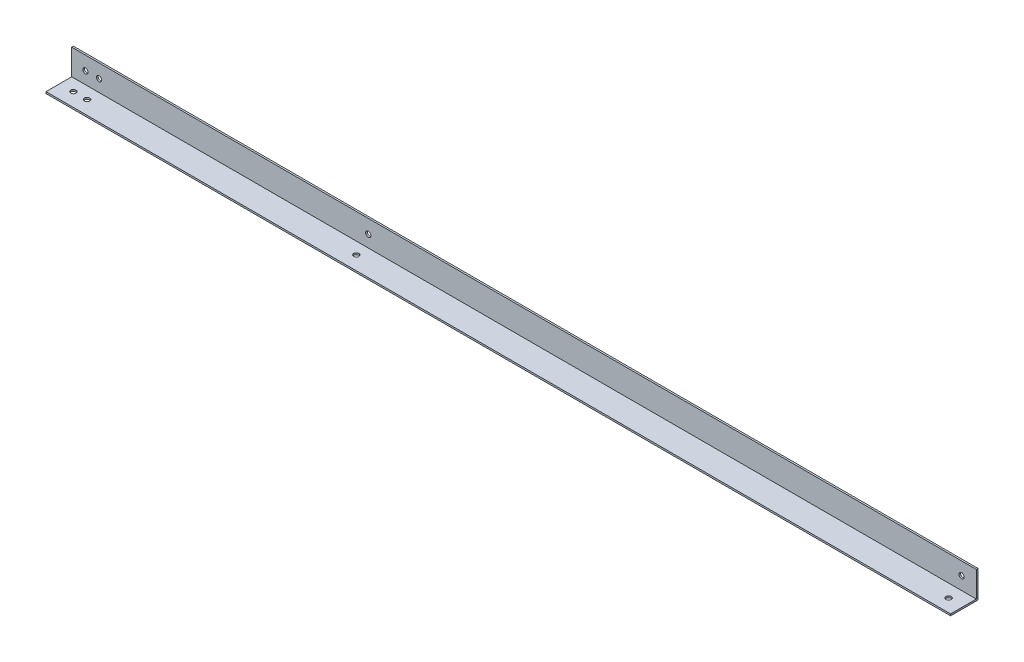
from build123d import *

# Parameters (mm, degrees)
BOSS_EXTRUDE1_DEPTH = 419.1
SKETCH2_R           = 2.4257
CUT_EXTRUDE1_DEPTH  = 421.636577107


with BuildPart() as part:
    # Sketch1 → Boss-Extrude1 (new, symmetric)
    with BuildSketch(Plane.YZ):
        Polygon((0, 0), (25.4, 0), (25.4, 1.5875), (1.5875, 1.5875), (1.5875, 25.4), (0, 25.4), align=None)
    extrude(amount=BOSS_EXTRUDE1_DEPTH, both=True)

    # Sketch2 → Cut-Extrude1 (cut, through all)
    with BuildSketch(Plane(origin=(0, 0, 0), x_dir=(-1, 0, 0), z_dir=(0, 1, 0))):
        with Locations(Location((-405.383605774, 13.49375, 0), (0, 0, 270))):
            Circle(SKETCH2_R)
        with Locations(Location((393.7, 12.7, 0), (0, 0, 270))):
            Circle(SKETCH2_R)
        with Locations(Location((144.27708, 12.7, 0), (0, 0, 270))):
            Circle(SKETCH2_R)
        with Locations(Location((406.4, 12.7, 0), (0, 0, 270))):
            Circle(SKETCH2_R)
    cut_extrude1 = extrude(amount=CUT_EXTRUDE1_DEPTH, mode=Mode.SUBTRACT)

    # Mirror1: Cut-Extrude1 across plane
    add(cut_extrude1.mirror(Plane(origin=(0, 0, 0), x_dir=(0, 0.7071067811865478, 0.7071067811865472), z_dir=(0, 0.7071067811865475, -0.7071067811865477))), mode=Mode.SUBTRACT)


solid = part.part
